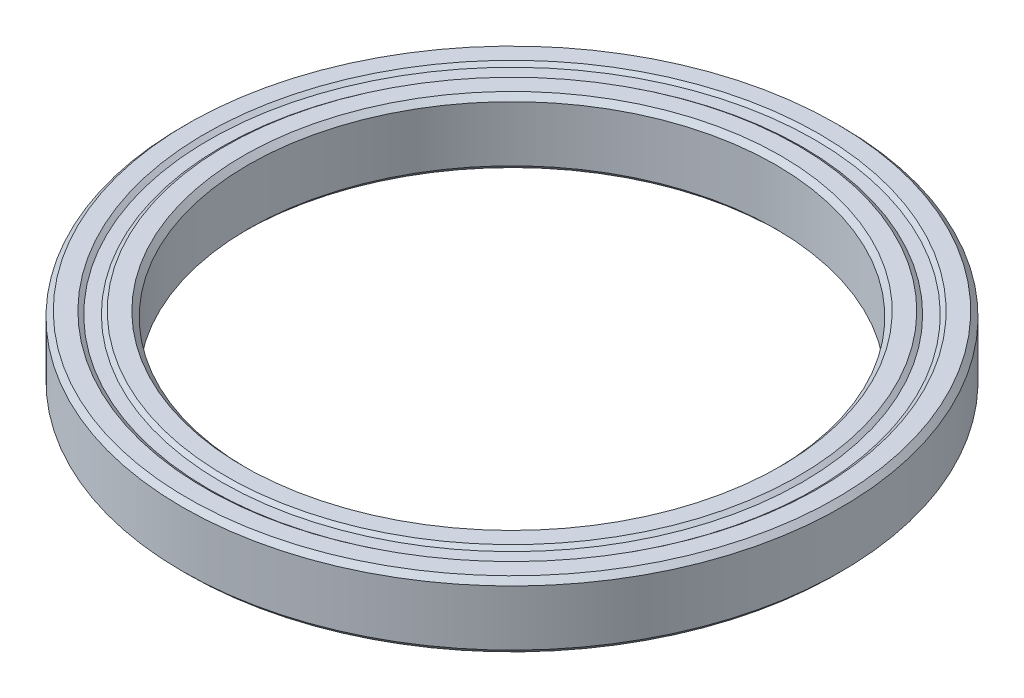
ISO-10303-21;
HEADER;
FILE_DESCRIPTION(('STEP AP214'),'2;1');
FILE_NAME('part.step','',(''),(''),'','','');
FILE_SCHEMA(('AUTOMOTIVE_DESIGN { 1 0 10303 214 1 1 1 1 }'));
ENDSEC;
DATA;
#1=APPLICATION_CONTEXT('core data for automotive mechanical design processes');
#2=APPLICATION_PROTOCOL_DEFINITION('international standard','automotive_design',2000,#1);
#3=PRODUCT_CONTEXT('',#1,'mechanical');
#4=PRODUCT('Part','Part','',(#3));
#5=PRODUCT_RELATED_PRODUCT_CATEGORY('part','',(#4));
#6=PRODUCT_DEFINITION_FORMATION('','',#4);
#7=PRODUCT_DEFINITION_CONTEXT('part definition',#1,'design');
#8=PRODUCT_DEFINITION('design','',#6,#7);
#9=PRODUCT_DEFINITION_SHAPE('','',#8);
#10=(LENGTH_UNIT() NAMED_UNIT(*) SI_UNIT(.MILLI.,.METRE.));
#11=(NAMED_UNIT(*) PLANE_ANGLE_UNIT() SI_UNIT($,.RADIAN.));
#12=(NAMED_UNIT(*) SI_UNIT($,.STERADIAN.) SOLID_ANGLE_UNIT());
#13=UNCERTAINTY_MEASURE_WITH_UNIT(LENGTH_MEASURE(1.E-05),#10,'distance_accuracy_value','');
#14=(GEOMETRIC_REPRESENTATION_CONTEXT(3) GLOBAL_UNCERTAINTY_ASSIGNED_CONTEXT((#13)) GLOBAL_UNIT_ASSIGNED_CONTEXT((#10,
#11,#12)) REPRESENTATION_CONTEXT('',''));
#15=CARTESIAN_POINT('',(0.,0.,0.));
#16=DIRECTION('',(0.,0.,1.));
#17=DIRECTION('',(1.,0.,0.));
#18=AXIS2_PLACEMENT_3D('',#15,#16,#17);
#19=CARTESIAN_POINT('',(1001.11465111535,1020.71700558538,1022.62067815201));
#20=DIRECTION('',(0.,-1.,0.));
#21=DIRECTION('',(0.,0.,-1.));
#22=AXIS2_PLACEMENT_3D('',#19,#20,#21);
#23=PLANE('',#22);
#24=CARTESIAN_POINT('',(1026.51465111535,1020.71700558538,1022.62067815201));
#25=DIRECTION('',(0.,-1.,0.));
#26=DIRECTION('',(0.,0.,-1.));
#27=AXIS2_PLACEMENT_3D('',#24,#25,#26);
#28=CIRCLE('',#27,25.9);
#29=CARTESIAN_POINT('',(1026.51465111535,1020.71700558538,996.720678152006));
#30=VERTEX_POINT('',#29);
#31=EDGE_CURVE('E93',#30,#30,#28,.T.);
#32=ORIENTED_EDGE('',*,*,#31,.T.);
#33=EDGE_LOOP('',(#32));
#34=FACE_BOUND('',#33,.T.);
#35=CARTESIAN_POINT('',(1026.51465111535,1020.71700558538,1022.62067815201));
#36=DIRECTION('',(0.,-1.,0.));
#37=DIRECTION('',(0.,0.,-1.));
#38=AXIS2_PLACEMENT_3D('',#35,#36,#37);
#39=CIRCLE('',#38,27.575);
#40=CARTESIAN_POINT('',(1026.51465111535,1020.71700558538,995.045678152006));
#41=VERTEX_POINT('',#40);
#42=EDGE_CURVE('E51',#41,#41,#39,.T.);
#43=ORIENTED_EDGE('',*,*,#42,.F.);
#44=EDGE_LOOP('',(#43));
#45=FACE_BOUND('',#44,.T.);
#46=ADVANCED_FACE('F15',(#34,#45),#23,.F.);
#47=CARTESIAN_POINT('',(998.539651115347,1020.41700558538,1022.62067815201));
#48=DIRECTION('',(0.,-1.,0.));
#49=DIRECTION('',(0.,0.,-1.));
#50=AXIS2_PLACEMENT_3D('',#47,#48,#49);
#51=PLANE('',#50);
#52=CARTESIAN_POINT('',(1026.51465111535,1020.41700558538,1022.62067815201));
#53=DIRECTION('',(0.,-1.,0.));
#54=DIRECTION('',(0.,0.,-1.));
#55=AXIS2_PLACEMENT_3D('',#52,#53,#54);
#56=CIRCLE('',#55,27.975);
#57=CARTESIAN_POINT('',(1026.51465111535,1020.41700558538,994.645678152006));
#58=VERTEX_POINT('',#57);
#59=EDGE_CURVE('E46',#58,#58,#56,.T.);
#60=ORIENTED_EDGE('',*,*,#59,.T.);
#61=EDGE_LOOP('',(#60));
#62=FACE_BOUND('',#61,.T.);
#63=CARTESIAN_POINT('',(1026.51465111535,1020.41700558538,1022.62067815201));
#64=DIRECTION('',(0.,-1.,0.));
#65=DIRECTION('',(0.,0.,-1.));
#66=AXIS2_PLACEMENT_3D('',#63,#64,#65);
#67=CIRCLE('',#66,29.175);
#68=CARTESIAN_POINT('',(1026.51465111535,1020.41700558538,993.445678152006));
#69=VERTEX_POINT('',#68);
#70=EDGE_CURVE('E50',#69,#69,#67,.T.);
#71=ORIENTED_EDGE('',*,*,#70,.F.);
#72=EDGE_LOOP('',(#71));
#73=FACE_BOUND('',#72,.T.);
#74=ADVANCED_FACE('F129',(#62,#73),#51,.F.);
#75=CARTESIAN_POINT('',(996.939651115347,1020.71700558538,1022.62067815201));
#76=DIRECTION('',(0.,-1.,0.));
#77=DIRECTION('',(0.,0.,-1.));
#78=AXIS2_PLACEMENT_3D('',#75,#76,#77);
#79=PLANE('',#78);
#80=CARTESIAN_POINT('',(1026.51465111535,1020.71700558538,1022.62067815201));
#81=DIRECTION('',(0.,-1.,0.));
#82=DIRECTION('',(0.,0.,-1.));
#83=AXIS2_PLACEMENT_3D('',#80,#81,#82);
#84=CIRCLE('',#83,29.575);
#85=CARTESIAN_POINT('',(1026.51465111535,1020.71700558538,993.045678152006));
#86=VERTEX_POINT('',#85);
#87=EDGE_CURVE('E55',#86,#86,#84,.T.);
#88=ORIENTED_EDGE('',*,*,#87,.T.);
#89=EDGE_LOOP('',(#88));
#90=FACE_BOUND('',#89,.T.);
#91=CARTESIAN_POINT('',(1026.51465111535,1020.71700558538,1022.62067815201));
#92=DIRECTION('',(0.,1.,0.));
#93=DIRECTION('',(0.,0.,-1.));
#94=AXIS2_PLACEMENT_3D('',#91,#92,#93);
#95=CIRCLE('',#94,31.25);
#96=CARTESIAN_POINT('',(1026.51465111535,1020.71700558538,991.370678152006));
#97=VERTEX_POINT('',#96);
#98=EDGE_CURVE('E41',#97,#97,#95,.T.);
#99=ORIENTED_EDGE('',*,*,#98,.T.);
#100=EDGE_LOOP('',(#99));
#101=FACE_BOUND('',#100,.T.);
#102=ADVANCED_FACE('F75',(#90,#101),#79,.F.);
#103=CARTESIAN_POINT('',(996.939651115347,1014.36700558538,1022.62067815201));
#104=DIRECTION('',(0.,1.,0.));
#105=DIRECTION('',(1.,0.,0.));
#106=AXIS2_PLACEMENT_3D('',#103,#104,#105);
#107=PLANE('',#106);
#108=CARTESIAN_POINT('',(1026.51465111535,1014.36700558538,1022.62067815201));
#109=DIRECTION('',(0.,-1.,0.));
#110=DIRECTION('',(0.,0.,-1.));
#111=AXIS2_PLACEMENT_3D('',#108,#109,#110);
#112=CIRCLE('',#111,29.575);
#113=CARTESIAN_POINT('',(1026.51465111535,1014.36700558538,993.045678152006));
#114=VERTEX_POINT('',#113);
#115=EDGE_CURVE('E32',#114,#114,#112,.T.);
#116=ORIENTED_EDGE('',*,*,#115,.F.);
#117=EDGE_LOOP('',(#116));
#118=FACE_BOUND('',#117,.T.);
#119=CARTESIAN_POINT('',(1026.51465111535,1014.36700558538,1022.62067815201));
#120=DIRECTION('',(0.,-1.,0.));
#121=DIRECTION('',(0.,0.,1.));
#122=AXIS2_PLACEMENT_3D('',#119,#120,#121);
#123=CIRCLE('',#122,31.25);
#124=CARTESIAN_POINT('',(1026.51465111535,1014.36700558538,1053.87067815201));
#125=VERTEX_POINT('',#124);
#126=EDGE_CURVE('E35',#125,#125,#123,.T.);
#127=ORIENTED_EDGE('',*,*,#126,.T.);
#128=EDGE_LOOP('',(#127));
#129=FACE_BOUND('',#128,.T.);
#130=ADVANCED_FACE('F71',(#118,#129),#107,.F.);
#131=CARTESIAN_POINT('',(998.539651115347,1014.66700558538,1022.62067815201));
#132=DIRECTION('',(0.,1.,0.));
#133=DIRECTION('',(1.,0.,0.));
#134=AXIS2_PLACEMENT_3D('',#131,#132,#133);
#135=PLANE('',#134);
#136=CARTESIAN_POINT('',(1026.51465111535,1014.66700558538,1022.62067815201));
#137=DIRECTION('',(0.,-1.,0.));
#138=DIRECTION('',(0.,0.,-1.));
#139=AXIS2_PLACEMENT_3D('',#136,#137,#138);
#140=CIRCLE('',#139,27.975);
#141=CARTESIAN_POINT('',(1026.51465111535,1014.66700558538,994.645678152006));
#142=VERTEX_POINT('',#141);
#143=EDGE_CURVE('E10',#142,#142,#140,.T.);
#144=ORIENTED_EDGE('',*,*,#143,.F.);
#145=EDGE_LOOP('',(#144));
#146=FACE_BOUND('',#145,.T.);
#147=CARTESIAN_POINT('',(1026.51465111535,1014.66700558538,1022.62067815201));
#148=DIRECTION('',(0.,-1.,0.));
#149=DIRECTION('',(0.,0.,-1.));
#150=AXIS2_PLACEMENT_3D('',#147,#148,#149);
#151=CIRCLE('',#150,29.175);
#152=CARTESIAN_POINT('',(1026.51465111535,1014.66700558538,993.445678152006));
#153=VERTEX_POINT('',#152);
#154=EDGE_CURVE('E59',#153,#153,#151,.T.);
#155=ORIENTED_EDGE('',*,*,#154,.T.);
#156=EDGE_LOOP('',(#155));
#157=FACE_BOUND('',#156,.T.);
#158=ADVANCED_FACE('F74',(#146,#157),#135,.F.);
#159=CARTESIAN_POINT('',(1001.11465111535,1014.36700558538,1022.62067815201));
#160=DIRECTION('',(0.,1.,0.));
#161=DIRECTION('',(1.,0.,0.));
#162=AXIS2_PLACEMENT_3D('',#159,#160,#161);
#163=PLANE('',#162);
#164=CARTESIAN_POINT('',(1026.51465111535,1014.36700558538,1022.62067815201));
#165=DIRECTION('',(0.,1.,0.));
#166=DIRECTION('',(0.,0.,1.));
#167=AXIS2_PLACEMENT_3D('',#164,#165,#166);
#168=CIRCLE('',#167,25.9);
#169=CARTESIAN_POINT('',(1026.51465111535,1014.36700558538,1048.52067815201));
#170=VERTEX_POINT('',#169);
#171=EDGE_CURVE('E81',#170,#170,#168,.T.);
#172=ORIENTED_EDGE('',*,*,#171,.T.);
#173=EDGE_LOOP('',(#172));
#174=FACE_BOUND('',#173,.T.);
#175=CARTESIAN_POINT('',(1026.51465111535,1014.36700558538,1022.62067815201));
#176=DIRECTION('',(0.,-1.,0.));
#177=DIRECTION('',(0.,0.,-1.));
#178=AXIS2_PLACEMENT_3D('',#175,#176,#177);
#179=CIRCLE('',#178,27.575);
#180=CARTESIAN_POINT('',(1026.51465111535,1014.36700558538,995.045678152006));
#181=VERTEX_POINT('',#180);
#182=EDGE_CURVE('E18',#181,#181,#179,.T.);
#183=ORIENTED_EDGE('',*,*,#182,.T.);
#184=EDGE_LOOP('',(#183));
#185=FACE_BOUND('',#184,.T.);
#186=ADVANCED_FACE('F162',(#174,#185),#163,.F.);
#187=CARTESIAN_POINT('',(1026.51465111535,1014.36700558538,1022.62067815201));
#188=DIRECTION('',(0.,-1.,0.));
#189=DIRECTION('',(0.,0.,-1.));
#190=AXIS2_PLACEMENT_3D('',#187,#188,#189);
#191=CYLINDRICAL_SURFACE('',#190,25.4);
#192=CARTESIAN_POINT('',(1026.51465111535,1014.86700558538,1022.62067815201));
#193=DIRECTION('',(0.,-1.,0.));
#194=DIRECTION('',(0.,0.,1.));
#195=AXIS2_PLACEMENT_3D('',#192,#193,#194);
#196=CIRCLE('',#195,25.4);
#197=CARTESIAN_POINT('',(1026.51465111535,1014.86700558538,1048.02067815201));
#198=VERTEX_POINT('',#197);
#199=EDGE_CURVE('E86',#198,#198,#196,.T.);
#200=ORIENTED_EDGE('',*,*,#199,.T.);
#201=EDGE_LOOP('',(#200));
#202=FACE_BOUND('',#201,.T.);
#203=CARTESIAN_POINT('',(1026.51465111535,1020.21700558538,1022.62067815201));
#204=DIRECTION('',(0.,1.,0.));
#205=DIRECTION('',(0.,0.,-1.));
#206=AXIS2_PLACEMENT_3D('',#203,#204,#205);
#207=CIRCLE('',#206,25.4);
#208=CARTESIAN_POINT('',(1026.51465111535,1020.21700558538,997.220678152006));
#209=VERTEX_POINT('',#208);
#210=EDGE_CURVE('E102',#209,#209,#207,.T.);
#211=ORIENTED_EDGE('',*,*,#210,.T.);
#212=EDGE_LOOP('',(#211));
#213=FACE_BOUND('',#212,.T.);
#214=ADVANCED_FACE('F112',(#202,#213),#191,.F.);
#215=CARTESIAN_POINT('',(1026.51465111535,1014.66700558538,1022.62067815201));
#216=DIRECTION('',(0.,1.,0.));
#217=DIRECTION('',(0.,0.,1.));
#218=AXIS2_PLACEMENT_3D('',#215,#216,#217);
#219=CONICAL_SURFACE('',#218,27.975,0.927295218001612);
#220=ORIENTED_EDGE('',*,*,#143,.T.);
#221=EDGE_LOOP('',(#220));
#222=FACE_BOUND('',#221,.T.);
#223=ORIENTED_EDGE('',*,*,#182,.F.);
#224=EDGE_LOOP('',(#223));
#225=FACE_BOUND('',#224,.T.);
#226=ADVANCED_FACE('F204',(#222,#225),#219,.T.);
#227=CARTESIAN_POINT('',(1026.51465111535,1014.36700558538,1022.62067815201));
#228=DIRECTION('',(0.,-1.,0.));
#229=DIRECTION('',(0.,0.,-1.));
#230=AXIS2_PLACEMENT_3D('',#227,#228,#229);
#231=CONICAL_SURFACE('',#230,29.575,0.927295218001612);
#232=ORIENTED_EDGE('',*,*,#115,.T.);
#233=EDGE_LOOP('',(#232));
#234=FACE_BOUND('',#233,.T.);
#235=ORIENTED_EDGE('',*,*,#154,.F.);
#236=EDGE_LOOP('',(#235));
#237=FACE_BOUND('',#236,.T.);
#238=ADVANCED_FACE('F68',(#234,#237),#231,.F.);
#239=CARTESIAN_POINT('',(1026.51465111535,1014.36700558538,1022.62067815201));
#240=DIRECTION('',(0.,-1.,0.));
#241=DIRECTION('',(0.,0.,-1.));
#242=AXIS2_PLACEMENT_3D('',#239,#240,#241);
#243=CYLINDRICAL_SURFACE('',#242,31.75);
#244=CARTESIAN_POINT('',(1026.51465111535,1014.86700558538,1022.62067815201));
#245=DIRECTION('',(0.,1.,0.));
#246=DIRECTION('',(0.,0.,1.));
#247=AXIS2_PLACEMENT_3D('',#244,#245,#246);
#248=CIRCLE('',#247,31.75);
#249=CARTESIAN_POINT('',(1026.51465111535,1014.86700558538,1054.37067815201));
#250=VERTEX_POINT('',#249);
#251=EDGE_CURVE('E37',#250,#250,#248,.T.);
#252=ORIENTED_EDGE('',*,*,#251,.T.);
#253=EDGE_LOOP('',(#252));
#254=FACE_BOUND('',#253,.T.);
#255=CARTESIAN_POINT('',(1026.51465111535,1020.21700558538,1022.62067815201));
#256=DIRECTION('',(0.,-1.,0.));
#257=DIRECTION('',(0.,0.,-1.));
#258=AXIS2_PLACEMENT_3D('',#255,#256,#257);
#259=CIRCLE('',#258,31.75);
#260=CARTESIAN_POINT('',(1026.51465111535,1020.21700558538,990.870678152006));
#261=VERTEX_POINT('',#260);
#262=EDGE_CURVE('E45',#261,#261,#259,.T.);
#263=ORIENTED_EDGE('',*,*,#262,.T.);
#264=EDGE_LOOP('',(#263));
#265=FACE_BOUND('',#264,.T.);
#266=ADVANCED_FACE('F150',(#254,#265),#243,.T.);
#267=CARTESIAN_POINT('',(1026.51465111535,1020.41700558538,1022.62067815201));
#268=DIRECTION('',(0.,1.,0.));
#269=DIRECTION('',(0.,0.,1.));
#270=AXIS2_PLACEMENT_3D('',#267,#268,#269);
#271=CONICAL_SURFACE('',#270,29.175,0.927295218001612);
#272=ORIENTED_EDGE('',*,*,#87,.F.);
#273=EDGE_LOOP('',(#272));
#274=FACE_BOUND('',#273,.T.);
#275=ORIENTED_EDGE('',*,*,#70,.T.);
#276=EDGE_LOOP('',(#275));
#277=FACE_BOUND('',#276,.T.);
#278=ADVANCED_FACE('F141',(#274,#277),#271,.F.);
#279=CARTESIAN_POINT('',(1026.51465111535,1020.71700558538,1022.62067815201));
#280=DIRECTION('',(0.,-1.,0.));
#281=DIRECTION('',(0.,0.,-1.));
#282=AXIS2_PLACEMENT_3D('',#279,#280,#281);
#283=CONICAL_SURFACE('',#282,27.575,0.927295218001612);
#284=ORIENTED_EDGE('',*,*,#59,.F.);
#285=EDGE_LOOP('',(#284));
#286=FACE_BOUND('',#285,.T.);
#287=ORIENTED_EDGE('',*,*,#42,.T.);
#288=EDGE_LOOP('',(#287));
#289=FACE_BOUND('',#288,.T.);
#290=ADVANCED_FACE('F138',(#286,#289),#283,.T.);
#291=CARTESIAN_POINT('',(1026.51465111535,1020.21700558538,1022.62067815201));
#292=DIRECTION('',(0.,-1.,0.));
#293=DIRECTION('',(0.,0.,-1.));
#294=AXIS2_PLACEMENT_3D('',#291,#292,#293);
#295=CONICAL_SURFACE('',#294,31.75,0.785398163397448);
#296=ORIENTED_EDGE('',*,*,#262,.F.);
#297=EDGE_LOOP('',(#296));
#298=FACE_BOUND('',#297,.T.);
#299=ORIENTED_EDGE('',*,*,#98,.F.);
#300=EDGE_LOOP('',(#299));
#301=FACE_BOUND('',#300,.T.);
#302=ADVANCED_FACE('F140',(#298,#301),#295,.T.);
#303=CARTESIAN_POINT('',(1026.51465111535,1014.36700558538,1022.62067815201));
#304=DIRECTION('',(0.,1.,0.));
#305=DIRECTION('',(0.,0.,1.));
#306=AXIS2_PLACEMENT_3D('',#303,#304,#305);
#307=CONICAL_SURFACE('',#306,31.25,0.785398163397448);
#308=ORIENTED_EDGE('',*,*,#251,.F.);
#309=EDGE_LOOP('',(#308));
#310=FACE_BOUND('',#309,.T.);
#311=ORIENTED_EDGE('',*,*,#126,.F.);
#312=EDGE_LOOP('',(#311));
#313=FACE_BOUND('',#312,.T.);
#314=ADVANCED_FACE('F123',(#310,#313),#307,.T.);
#315=CARTESIAN_POINT('',(1026.51465111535,1014.86700558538,1022.62067815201));
#316=DIRECTION('',(0.,-1.,0.));
#317=DIRECTION('',(0.,0.,-1.));
#318=AXIS2_PLACEMENT_3D('',#315,#316,#317);
#319=CONICAL_SURFACE('',#318,25.4,0.785398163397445);
#320=ORIENTED_EDGE('',*,*,#171,.F.);
#321=EDGE_LOOP('',(#320));
#322=FACE_BOUND('',#321,.T.);
#323=ORIENTED_EDGE('',*,*,#199,.F.);
#324=EDGE_LOOP('',(#323));
#325=FACE_BOUND('',#324,.T.);
#326=ADVANCED_FACE('F116',(#322,#325),#319,.F.);
#327=CARTESIAN_POINT('',(1026.51465111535,1020.71700558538,1022.62067815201));
#328=DIRECTION('',(0.,1.,0.));
#329=DIRECTION('',(0.,0.,1.));
#330=AXIS2_PLACEMENT_3D('',#327,#328,#329);
#331=CONICAL_SURFACE('',#330,25.9,0.785398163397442);
#332=ORIENTED_EDGE('',*,*,#31,.F.);
#333=EDGE_LOOP('',(#332));
#334=FACE_BOUND('',#333,.T.);
#335=ORIENTED_EDGE('',*,*,#210,.F.);
#336=EDGE_LOOP('',(#335));
#337=FACE_BOUND('',#336,.T.);
#338=ADVANCED_FACE('F114',(#334,#337),#331,.F.);
#339=CLOSED_SHELL('',(#46,#74,#102,#130,#158,#186,#214,#226,#238,#266,#278,#290,#302,#314,#326,#338));
#340=MANIFOLD_SOLID_BREP('B1',#339);
#341=ADVANCED_BREP_SHAPE_REPRESENTATION('',(#18,#340),#14);
#342=SHAPE_DEFINITION_REPRESENTATION(#9,#341);
ENDSEC;
END-ISO-10303-21;
